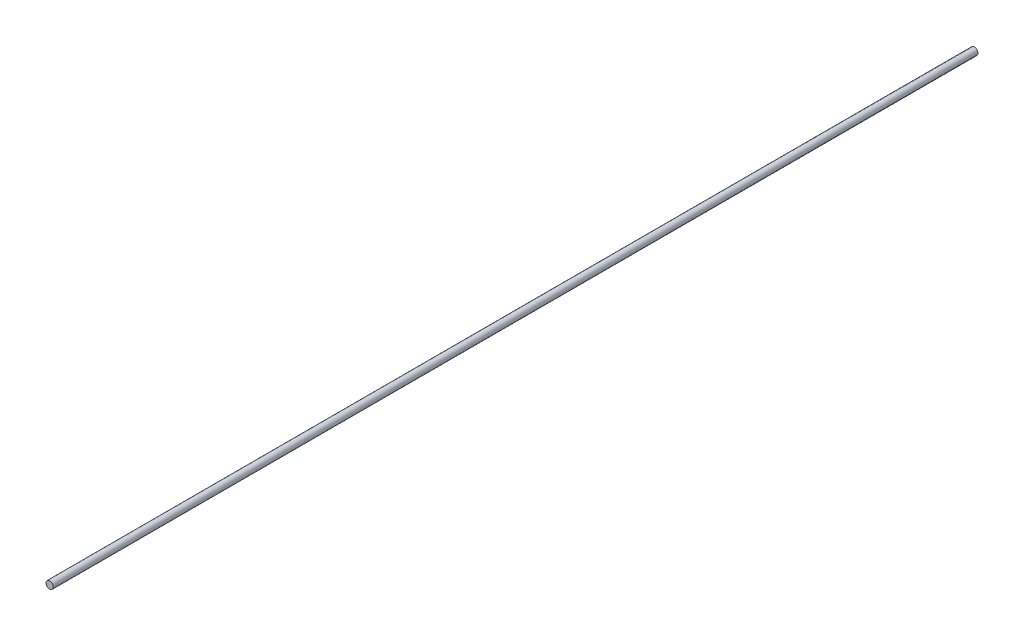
from build123d import *

# Parameters (mm, degrees)
SKETCH1_R           = 4.7625
BOSS_EXTRUDE1_DEPTH = 1219.2


with BuildPart() as part:
    # Sketch1 → Boss-Extrude1 (new body)
    with BuildSketch(Plane.XY):
        with Locations(Location((0, 0, 0), (0, 0, 180))):
            Circle(SKETCH1_R)
    extrude(amount=BOSS_EXTRUDE1_DEPTH)


solid = part.part
